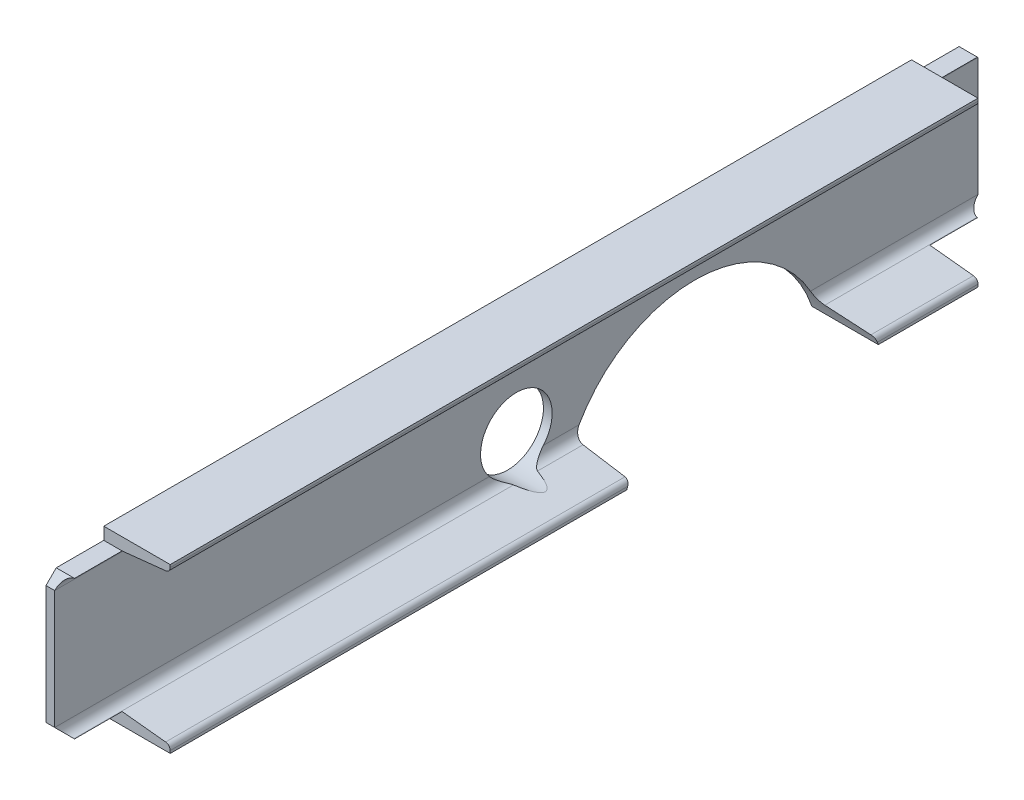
from build123d import *

# Parameters (mm, degrees)
EXTRUDE_1_DEPTH     = 451.5
SKETCH_2_W          = 65
SKETCH_2_H          = 12
CUT_EXTRUDE_1_DEPTH = 56.5
CUT_EXTRUDE_2_DEPTH = 464.116885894
SKETCH_4_R          = 35
CUT_EXTRUDE_3_DEPTH = 464.116886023
CHAMFER_1_SIZE      = 10


with BuildPart() as part:
    # Sketch 1 → Extrude 1 (new, symmetric)
    with BuildSketch(Plane.XY):
        with BuildLine():
            Line((65, 80), (0, 80))
            Line((0, 80), (0, -80))
            Line((0, -80), (65, -80))
            Line((65, -80), (65, -77.497140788))
            ThreePointArc((65, -77.497140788), (63.717527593, -74.153491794), (60.528004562, -72.52509783))
            Line((60.528004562, -72.52509783), (17.443990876, -67.949804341))
            ThreePointArc((17.443990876, -67.949804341), (11.064944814, -64.693016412), (8.5, -58.005718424))
            Line((8.5, -58.005718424), (8.5, 58.005718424))
            ThreePointArc((8.5, 58.005718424), (11.064944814, 64.693016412), (17.443990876, 67.949804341))
            Line((17.443990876, 67.949804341), (60.528004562, 72.52509783))
            ThreePointArc((60.528004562, 72.52509783), (63.717527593, 74.153491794), (65, 77.497140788))
            Line((65, 77.497140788), (65, 80))
        make_face()
    extrude(amount=EXTRUDE_1_DEPTH, both=True)

    # Sketch 2 → Cut-Extrude 1 (cut)
    with BuildSketch(Plane.XY.offset(451.5)):
        with Locations((32.5, 74)):
            Rectangle(SKETCH_2_W, SKETCH_2_H)
        with Locations((32.5, -74)):
            Rectangle(SKETCH_2_W, SKETCH_2_H)
    cut_extrude_1 = extrude(amount=-CUT_EXTRUDE_1_DEPTH, mode=Mode.SUBTRACT)

    # Mirror 1: Cut-Extrude 1 across plane
    add(cut_extrude_1.mirror(Plane.XY), mode=Mode.SUBTRACT)

    # Sketch 3 → Cut-Extrude 2 (cut, through all)
    with BuildSketch(Plane.ZY):
        with BuildLine():
            Line((-297.528451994, -80), (-51.471548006, -80))
            ThreePointArc((-51.471548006, -80), (-174.5, 8), (-297.528451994, -80))
        make_face()
    extrude(amount=-CUT_EXTRUDE_2_DEPTH, mode=Mode.SUBTRACT)

    # Sketch 4 → Cut-Extrude 3 (cut, through all)
    with BuildSketch(Plane.ZY):
        with Locations(Location((0, -35, 0), (0, 0, 270))):
            Circle(SKETCH_4_R)
    extrude(amount=-CUT_EXTRUDE_3_DEPTH, mode=Mode.SUBTRACT)

    # Chamfer 1
    chamfer_1_edges = [part.edges().sort_by_distance(p)[0] for p in [
        (8.958333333, -68, -451.5),
        (8.958333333, 68, -451.5),
        (8.958333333, -68, 451.5),
        (8.958333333, 68, 451.5),
    ]]
    chamfer(chamfer_1_edges, length=CHAMFER_1_SIZE)


solid = part.part
